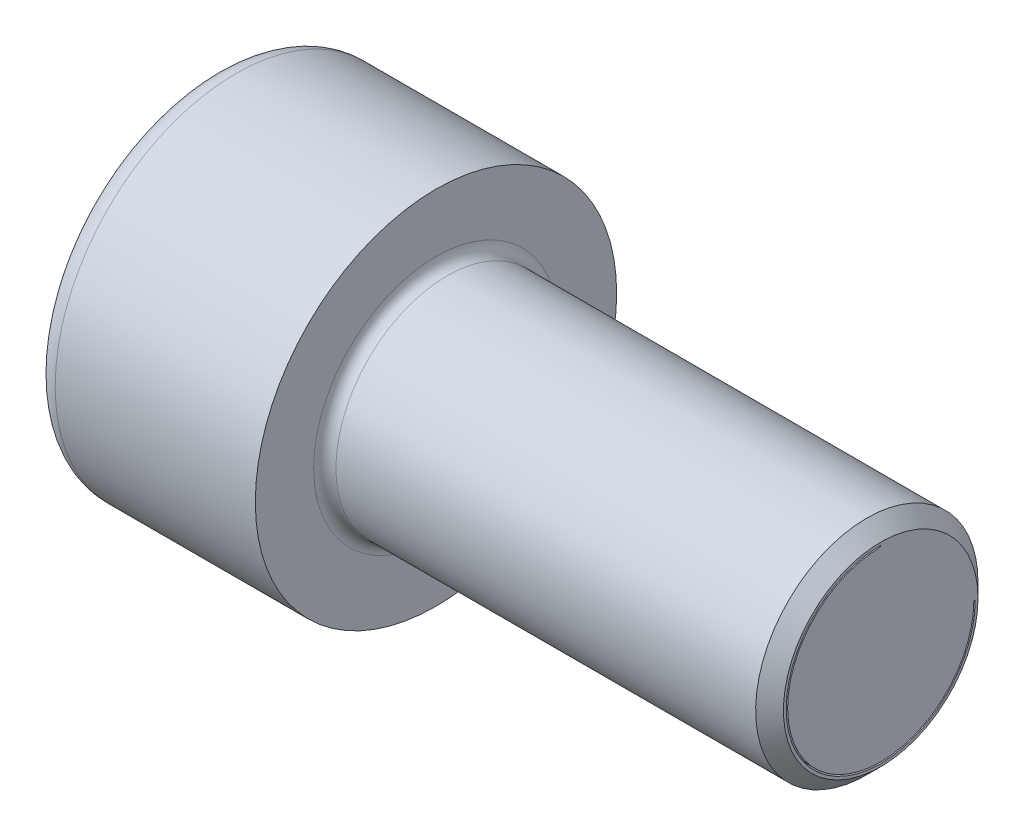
ISO-10303-21;
HEADER;
FILE_DESCRIPTION(('STEP AP214'),'2;1');
FILE_NAME('part.step','',(''),(''),'','','');
FILE_SCHEMA(('AUTOMOTIVE_DESIGN { 1 0 10303 214 1 1 1 1 }'));
ENDSEC;
DATA;
#1=APPLICATION_CONTEXT('core data for automotive mechanical design processes');
#2=APPLICATION_PROTOCOL_DEFINITION('international standard','automotive_design',2000,#1);
#3=PRODUCT_CONTEXT('',#1,'mechanical');
#4=PRODUCT('Part','Part','',(#3));
#5=PRODUCT_RELATED_PRODUCT_CATEGORY('part','',(#4));
#6=PRODUCT_DEFINITION_FORMATION('','',#4);
#7=PRODUCT_DEFINITION_CONTEXT('part definition',#1,'design');
#8=PRODUCT_DEFINITION('design','',#6,#7);
#9=PRODUCT_DEFINITION_SHAPE('','',#8);
#10=(LENGTH_UNIT() NAMED_UNIT(*) SI_UNIT(.MILLI.,.METRE.));
#11=(NAMED_UNIT(*) PLANE_ANGLE_UNIT() SI_UNIT($,.RADIAN.));
#12=(NAMED_UNIT(*) SI_UNIT($,.STERADIAN.) SOLID_ANGLE_UNIT());
#13=UNCERTAINTY_MEASURE_WITH_UNIT(LENGTH_MEASURE(1.E-05),#10,'distance_accuracy_value','');
#14=(GEOMETRIC_REPRESENTATION_CONTEXT(3) GLOBAL_UNCERTAINTY_ASSIGNED_CONTEXT((#13)) GLOBAL_UNIT_ASSIGNED_CONTEXT((#10,
#11,#12)) REPRESENTATION_CONTEXT('',''));
#15=CARTESIAN_POINT('',(0.,0.,0.));
#16=DIRECTION('',(0.,0.,1.));
#17=DIRECTION('',(1.,0.,0.));
#18=AXIS2_PLACEMENT_3D('',#15,#16,#17);
#19=CARTESIAN_POINT('',(-106.3,-32.,70.));
#20=DIRECTION('',(1.,0.,0.));
#21=DIRECTION('',(0.,0.,-1.));
#22=AXIS2_PLACEMENT_3D('',#19,#20,#21);
#23=PLANE('',#22);
#24=CARTESIAN_POINT('',(-106.3,-34.,70.));
#25=DIRECTION('',(-1.,0.,0.));
#26=DIRECTION('',(0.,1.,0.));
#27=AXIS2_PLACEMENT_3D('',#24,#25,#26);
#28=CIRCLE('',#27,3.35);
#29=CARTESIAN_POINT('',(-106.3,-34.,66.65));
#30=VERTEX_POINT('',#29);
#31=CARTESIAN_POINT('',(-106.3,-30.65,70.));
#32=VERTEX_POINT('',#31);
#33=EDGE_CURVE('E58',#30,#32,#28,.T.);
#34=ORIENTED_EDGE('',*,*,#33,.T.);
#35=DIRECTION('',(0.,1.,0.));
#36=VECTOR('',#35,1.);
#37=CARTESIAN_POINT('',(-106.3,-31.3125,70.));
#38=LINE('',#37,#36);
#39=CARTESIAN_POINT('',(-106.3,-30.6,70.));
#40=VERTEX_POINT('',#39);
#41=EDGE_CURVE('E183',#32,#40,#38,.T.);
#42=ORIENTED_EDGE('',*,*,#41,.T.);
#43=CARTESIAN_POINT('',(-106.3,-34.,70.));
#44=DIRECTION('',(1.,0.,0.));
#45=DIRECTION('',(0.,1.,0.));
#46=AXIS2_PLACEMENT_3D('',#43,#44,#45);
#47=CIRCLE('',#46,3.4);
#48=CARTESIAN_POINT('',(-106.3,-34.,66.6));
#49=VERTEX_POINT('',#48);
#50=EDGE_CURVE('E286',#40,#49,#47,.T.);
#51=ORIENTED_EDGE('',*,*,#50,.T.);
#52=DIRECTION('',(0.,0.,1.));
#53=VECTOR('',#52,1.);
#54=CARTESIAN_POINT('',(-106.3,-34.,68.3125));
#55=LINE('',#54,#53);
#56=EDGE_CURVE('E316',#49,#30,#55,.T.);
#57=ORIENTED_EDGE('',*,*,#56,.T.);
#58=EDGE_LOOP('',(#34,#42,#51,#57));
#59=FACE_BOUND('',#58,.T.);
#60=ADVANCED_FACE('F40',(#59),#23,.T.);
#61=CARTESIAN_POINT('',(-107.95,-34.,70.));
#62=DIRECTION('',(-1.,0.,0.));
#63=DIRECTION('',(0.,0.,1.));
#64=AXIS2_PLACEMENT_3D('',#61,#62,#63);
#65=CYLINDRICAL_SURFACE('',#64,4.);
#66=CARTESIAN_POINT('',(-94.5,-34.,70.));
#67=DIRECTION('',(1.,0.,0.));
#68=DIRECTION('',(0.,0.,-1.));
#69=AXIS2_PLACEMENT_3D('',#66,#67,#68);
#70=CIRCLE('',#69,4.);
#71=CARTESIAN_POINT('',(-94.5,-34.,66.));
#72=VERTEX_POINT('',#71);
#73=EDGE_CURVE('E11',#72,#72,#70,.F.);
#74=ORIENTED_EDGE('',*,*,#73,.T.);
#75=EDGE_LOOP('',(#74));
#76=FACE_BOUND('',#75,.T.);
#77=CARTESIAN_POINT('',(-109.6,-34.,70.));
#78=DIRECTION('',(1.,0.,0.));
#79=DIRECTION('',(0.,1.,0.));
#80=AXIS2_PLACEMENT_3D('',#77,#78,#79);
#81=CIRCLE('',#80,4.);
#82=CARTESIAN_POINT('',(-109.6,-30.,70.));
#83=VERTEX_POINT('',#82);
#84=EDGE_CURVE('E280',#83,#83,#81,.T.);
#85=ORIENTED_EDGE('',*,*,#84,.T.);
#86=EDGE_LOOP('',(#85));
#87=FACE_BOUND('',#86,.T.);
#88=ADVANCED_FACE('F204',(#76,#87),#65,.T.);
#89=CARTESIAN_POINT('',(-109.6,-34.,70.));
#90=DIRECTION('',(1.,0.,0.));
#91=DIRECTION('',(0.,0.,-1.));
#92=AXIS2_PLACEMENT_3D('',#89,#90,#91);
#93=TOROIDAL_SURFACE('',#92,4.40000000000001,0.4);
#94=CARTESIAN_POINT('',(-110.,-34.,70.));
#95=DIRECTION('',(1.,0.,0.));
#96=DIRECTION('',(0.,1.,0.));
#97=AXIS2_PLACEMENT_3D('',#94,#95,#96);
#98=CIRCLE('',#97,4.4);
#99=CARTESIAN_POINT('',(-110.,-29.6,70.));
#100=VERTEX_POINT('',#99);
#101=EDGE_CURVE('E171',#100,#100,#98,.T.);
#102=ORIENTED_EDGE('',*,*,#101,.T.);
#103=EDGE_LOOP('',(#102));
#104=FACE_BOUND('',#103,.T.);
#105=ORIENTED_EDGE('',*,*,#84,.F.);
#106=EDGE_LOOP('',(#105));
#107=FACE_BOUND('',#106,.T.);
#108=ADVANCED_FACE('F199',(#104,#107),#93,.F.);
#109=CARTESIAN_POINT('',(-110.,-28.55,70.));
#110=DIRECTION('',(1.,0.,0.));
#111=DIRECTION('',(0.,0.,-1.));
#112=AXIS2_PLACEMENT_3D('',#109,#110,#111);
#113=PLANE('',#112);
#114=CARTESIAN_POINT('',(-110.,-34.,70.));
#115=DIRECTION('',(1.,0.,0.));
#116=DIRECTION('',(0.,1.,0.));
#117=AXIS2_PLACEMENT_3D('',#114,#115,#116);
#118=CIRCLE('',#117,6.5);
#119=CARTESIAN_POINT('',(-110.,-27.5,70.));
#120=VERTEX_POINT('',#119);
#121=EDGE_CURVE('E168',#120,#120,#118,.T.);
#122=ORIENTED_EDGE('',*,*,#121,.T.);
#123=EDGE_LOOP('',(#122));
#124=FACE_BOUND('',#123,.T.);
#125=ORIENTED_EDGE('',*,*,#101,.F.);
#126=EDGE_LOOP('',(#125));
#127=FACE_BOUND('',#126,.T.);
#128=ADVANCED_FACE('F203',(#124,#127),#113,.T.);
#129=CARTESIAN_POINT('',(-113.6,-34.,70.));
#130=DIRECTION('',(-1.,0.,0.));
#131=DIRECTION('',(0.,0.,1.));
#132=AXIS2_PLACEMENT_3D('',#129,#130,#131);
#133=CYLINDRICAL_SURFACE('',#132,6.5);
#134=CARTESIAN_POINT('',(-117.2,-34.,70.));
#135=DIRECTION('',(1.,0.,0.));
#136=DIRECTION('',(0.,1.,0.));
#137=AXIS2_PLACEMENT_3D('',#134,#135,#136);
#138=CIRCLE('',#137,6.5);
#139=CARTESIAN_POINT('',(-117.2,-27.5,70.));
#140=VERTEX_POINT('',#139);
#141=EDGE_CURVE('E283',#140,#140,#138,.T.);
#142=ORIENTED_EDGE('',*,*,#141,.T.);
#143=EDGE_LOOP('',(#142));
#144=FACE_BOUND('',#143,.T.);
#145=ORIENTED_EDGE('',*,*,#121,.F.);
#146=EDGE_LOOP('',(#145));
#147=FACE_BOUND('',#146,.T.);
#148=ADVANCED_FACE('F209',(#144,#147),#133,.T.);
#149=CARTESIAN_POINT('',(-117.2,-34.,70.));
#150=DIRECTION('',(1.,0.,0.));
#151=DIRECTION('',(0.,0.,-1.));
#152=AXIS2_PLACEMENT_3D('',#149,#150,#151);
#153=TOROIDAL_SURFACE('',#152,5.7,0.8);
#154=CARTESIAN_POINT('',(-118.,-34.,70.));
#155=DIRECTION('',(1.,0.,0.));
#156=DIRECTION('',(0.,1.,0.));
#157=AXIS2_PLACEMENT_3D('',#154,#155,#156);
#158=CIRCLE('',#157,5.7);
#159=CARTESIAN_POINT('',(-118.,-28.3,70.));
#160=VERTEX_POINT('',#159);
#161=EDGE_CURVE('E298',#160,#160,#158,.T.);
#162=ORIENTED_EDGE('',*,*,#161,.T.);
#163=EDGE_LOOP('',(#162));
#164=FACE_BOUND('',#163,.T.);
#165=ORIENTED_EDGE('',*,*,#141,.F.);
#166=EDGE_LOOP('',(#165));
#167=FACE_BOUND('',#166,.T.);
#168=ADVANCED_FACE('F213',(#164,#167),#153,.T.);
#169=CARTESIAN_POINT('',(-118.,-31.15,70.));
#170=DIRECTION('',(-1.,0.,0.));
#171=DIRECTION('',(0.,0.,1.));
#172=AXIS2_PLACEMENT_3D('',#169,#170,#171);
#173=PLANE('',#172);
#174=ORIENTED_EDGE('',*,*,#161,.F.);
#175=EDGE_LOOP('',(#174));
#176=FACE_BOUND('',#175,.T.);
#177=DIRECTION('',(0.,-0.5,-0.86602540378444));
#178=VECTOR('',#177,1.);
#179=CARTESIAN_POINT('',(-118.,-35.8088135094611,72.8670431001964));
#180=LINE('',#179,#178);
#181=CARTESIAN_POINT('',(-118.,-35.7320508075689,73.));
#182=VERTEX_POINT('',#181);
#183=CARTESIAN_POINT('',(-118.,-37.4641016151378,70.));
#184=VERTEX_POINT('',#183);
#185=EDGE_CURVE('E172',#182,#184,#180,.T.);
#186=ORIENTED_EDGE('',*,*,#185,.T.);
#187=DIRECTION('',(0.,0.5,-0.866025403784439));
#188=VECTOR('',#187,1.);
#189=CARTESIAN_POINT('',(-118.,-36.6748389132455,68.6329568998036));
#190=LINE('',#189,#188);
#191=CARTESIAN_POINT('',(-118.,-35.7320508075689,67.));
#192=VERTEX_POINT('',#191);
#193=EDGE_CURVE('E293',#184,#192,#190,.T.);
#194=ORIENTED_EDGE('',*,*,#193,.T.);
#195=DIRECTION('',(0.,1.,0.));
#196=VECTOR('',#195,1.);
#197=CARTESIAN_POINT('',(-118.,-33.4410254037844,67.));
#198=LINE('',#197,#196);
#199=CARTESIAN_POINT('',(-118.,-32.2679491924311,67.));
#200=VERTEX_POINT('',#199);
#201=EDGE_CURVE('E132',#192,#200,#198,.T.);
#202=ORIENTED_EDGE('',*,*,#201,.T.);
#203=DIRECTION('',(0.,0.5,0.86602540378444));
#204=VECTOR('',#203,1.);
#205=CARTESIAN_POINT('',(-118.,-31.4786864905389,68.3670431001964));
#206=LINE('',#205,#204);
#207=CARTESIAN_POINT('',(-118.,-30.5358983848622,70.));
#208=VERTEX_POINT('',#207);
#209=EDGE_CURVE('E294',#200,#208,#206,.T.);
#210=ORIENTED_EDGE('',*,*,#209,.T.);
#211=DIRECTION('',(0.,-0.5,0.866025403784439));
#212=VECTOR('',#211,1.);
#213=CARTESIAN_POINT('',(-118.,-30.6126610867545,70.1329568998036));
#214=LINE('',#213,#212);
#215=CARTESIAN_POINT('',(-118.,-32.2679491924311,73.0000000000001));
#216=VERTEX_POINT('',#215);
#217=EDGE_CURVE('E176',#208,#216,#214,.T.);
#218=ORIENTED_EDGE('',*,*,#217,.T.);
#219=DIRECTION('',(0.,-1.,0.));
#220=VECTOR('',#219,1.);
#221=CARTESIAN_POINT('',(-118.,-31.7089745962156,73.));
#222=LINE('',#221,#220);
#223=EDGE_CURVE('E173',#216,#182,#222,.T.);
#224=ORIENTED_EDGE('',*,*,#223,.T.);
#225=EDGE_LOOP('',(#186,#194,#202,#210,#218,#224));
#226=FACE_BOUND('',#225,.T.);
#227=ADVANCED_FACE('F217',(#176,#226),#173,.T.);
#228=CARTESIAN_POINT('',(-114.,-34.,70.));
#229=DIRECTION('',(-1.,0.,0.));
#230=DIRECTION('',(0.,0.,1.));
#231=AXIS2_PLACEMENT_3D('',#228,#229,#230);
#232=PLANE('',#231);
#233=DIRECTION('',(0.,1.,0.));
#234=VECTOR('',#233,1.);
#235=CARTESIAN_POINT('',(-114.,-35.7320508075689,73.));
#236=LINE('',#235,#234);
#237=CARTESIAN_POINT('',(-114.,-35.7320508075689,73.));
#238=VERTEX_POINT('',#237);
#239=CARTESIAN_POINT('',(-114.,-32.2679491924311,73.0000000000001));
#240=VERTEX_POINT('',#239);
#241=EDGE_CURVE('E177',#238,#240,#236,.T.);
#242=ORIENTED_EDGE('',*,*,#241,.T.);
#243=DIRECTION('',(0.,0.5,-0.866025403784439));
#244=VECTOR('',#243,1.);
#245=CARTESIAN_POINT('',(-114.,-32.2679491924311,73.0000000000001));
#246=LINE('',#245,#244);
#247=CARTESIAN_POINT('',(-114.,-30.5358983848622,70.));
#248=VERTEX_POINT('',#247);
#249=EDGE_CURVE('E158',#240,#248,#246,.T.);
#250=ORIENTED_EDGE('',*,*,#249,.T.);
#251=DIRECTION('',(0.,-0.5,-0.86602540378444));
#252=VECTOR('',#251,1.);
#253=CARTESIAN_POINT('',(-114.,-30.5358983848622,70.));
#254=LINE('',#253,#252);
#255=CARTESIAN_POINT('',(-114.,-32.2679491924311,67.));
#256=VERTEX_POINT('',#255);
#257=EDGE_CURVE('E152',#248,#256,#254,.T.);
#258=ORIENTED_EDGE('',*,*,#257,.T.);
#259=DIRECTION('',(0.,-1.,0.));
#260=VECTOR('',#259,1.);
#261=CARTESIAN_POINT('',(-114.,-32.2679491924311,67.));
#262=LINE('',#261,#260);
#263=CARTESIAN_POINT('',(-114.,-35.7320508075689,67.));
#264=VERTEX_POINT('',#263);
#265=EDGE_CURVE('E130',#256,#264,#262,.T.);
#266=ORIENTED_EDGE('',*,*,#265,.T.);
#267=DIRECTION('',(0.,-0.5,0.866025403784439));
#268=VECTOR('',#267,1.);
#269=CARTESIAN_POINT('',(-114.,-35.7320508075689,67.));
#270=LINE('',#269,#268);
#271=CARTESIAN_POINT('',(-114.,-37.4641016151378,70.));
#272=VERTEX_POINT('',#271);
#273=EDGE_CURVE('E141',#264,#272,#270,.T.);
#274=ORIENTED_EDGE('',*,*,#273,.T.);
#275=DIRECTION('',(0.,0.5,0.86602540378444));
#276=VECTOR('',#275,1.);
#277=CARTESIAN_POINT('',(-114.,-37.4641016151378,70.));
#278=LINE('',#277,#276);
#279=EDGE_CURVE('E146',#272,#238,#278,.T.);
#280=ORIENTED_EDGE('',*,*,#279,.T.);
#281=EDGE_LOOP('',(#242,#250,#258,#266,#274,#280));
#282=FACE_BOUND('',#281,.T.);
#283=ADVANCED_FACE('F150',(#282),#232,.T.);
#284=CARTESIAN_POINT('',(-114.,-35.7320508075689,67.));
#285=DIRECTION('',(0.,0.,1.));
#286=DIRECTION('',(1.,0.,0.));
#287=AXIS2_PLACEMENT_3D('',#284,#285,#286);
#288=PLANE('',#287);
#289=ORIENTED_EDGE('',*,*,#201,.F.);
#290=DIRECTION('',(-1.,0.,0.));
#291=VECTOR('',#290,1.);
#292=CARTESIAN_POINT('',(-114.,-35.7320508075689,67.));
#293=LINE('',#292,#291);
#294=EDGE_CURVE('E126',#264,#192,#293,.T.);
#295=ORIENTED_EDGE('',*,*,#294,.F.);
#296=ORIENTED_EDGE('',*,*,#265,.F.);
#297=DIRECTION('',(-1.,0.,0.));
#298=VECTOR('',#297,1.);
#299=CARTESIAN_POINT('',(-114.,-32.2679491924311,67.));
#300=LINE('',#299,#298);
#301=EDGE_CURVE('E136',#256,#200,#300,.T.);
#302=ORIENTED_EDGE('',*,*,#301,.T.);
#303=EDGE_LOOP('',(#289,#295,#296,#302));
#304=FACE_BOUND('',#303,.T.);
#305=ADVANCED_FACE('F128',(#304),#288,.T.);
#306=CARTESIAN_POINT('',(-114.,-37.4641016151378,70.));
#307=DIRECTION('',(0.,0.866025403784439,0.5));
#308=DIRECTION('',(0.,-0.5,0.866025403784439));
#309=AXIS2_PLACEMENT_3D('',#306,#307,#308);
#310=PLANE('',#309);
#311=ORIENTED_EDGE('',*,*,#193,.F.);
#312=DIRECTION('',(-1.,0.,0.));
#313=VECTOR('',#312,1.);
#314=CARTESIAN_POINT('',(-114.,-37.4641016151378,70.));
#315=LINE('',#314,#313);
#316=EDGE_CURVE('E137',#272,#184,#315,.T.);
#317=ORIENTED_EDGE('',*,*,#316,.F.);
#318=ORIENTED_EDGE('',*,*,#273,.F.);
#319=ORIENTED_EDGE('',*,*,#294,.T.);
#320=EDGE_LOOP('',(#311,#317,#318,#319));
#321=FACE_BOUND('',#320,.T.);
#322=ADVANCED_FACE('F142',(#321),#310,.T.);
#323=CARTESIAN_POINT('',(-114.,-35.7320508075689,73.));
#324=DIRECTION('',(0.,0.86602540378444,-0.5));
#325=DIRECTION('',(0.,0.5,0.86602540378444));
#326=AXIS2_PLACEMENT_3D('',#323,#324,#325);
#327=PLANE('',#326);
#328=ORIENTED_EDGE('',*,*,#185,.F.);
#329=DIRECTION('',(-1.,0.,0.));
#330=VECTOR('',#329,1.);
#331=CARTESIAN_POINT('',(-114.,-35.7320508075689,73.));
#332=LINE('',#331,#330);
#333=EDGE_CURVE('E180',#238,#182,#332,.T.);
#334=ORIENTED_EDGE('',*,*,#333,.F.);
#335=ORIENTED_EDGE('',*,*,#279,.F.);
#336=ORIENTED_EDGE('',*,*,#316,.T.);
#337=EDGE_LOOP('',(#328,#334,#335,#336));
#338=FACE_BOUND('',#337,.T.);
#339=ADVANCED_FACE('F228',(#338),#327,.T.);
#340=CARTESIAN_POINT('',(-114.,-32.2679491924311,73.0000000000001));
#341=DIRECTION('',(0.,0.,-1.));
#342=DIRECTION('',(-1.,0.,0.));
#343=AXIS2_PLACEMENT_3D('',#340,#341,#342);
#344=PLANE('',#343);
#345=ORIENTED_EDGE('',*,*,#223,.F.);
#346=DIRECTION('',(-1.,0.,0.));
#347=VECTOR('',#346,1.);
#348=CARTESIAN_POINT('',(-114.,-32.2679491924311,73.0000000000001));
#349=LINE('',#348,#347);
#350=EDGE_CURVE('E167',#240,#216,#349,.T.);
#351=ORIENTED_EDGE('',*,*,#350,.F.);
#352=ORIENTED_EDGE('',*,*,#241,.F.);
#353=ORIENTED_EDGE('',*,*,#333,.T.);
#354=EDGE_LOOP('',(#345,#351,#352,#353));
#355=FACE_BOUND('',#354,.T.);
#356=ADVANCED_FACE('F231',(#355),#344,.T.);
#357=CARTESIAN_POINT('',(-114.,-30.5358983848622,70.));
#358=DIRECTION('',(0.,-0.866025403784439,-0.5));
#359=DIRECTION('',(0.,0.5,-0.866025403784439));
#360=AXIS2_PLACEMENT_3D('',#357,#358,#359);
#361=PLANE('',#360);
#362=ORIENTED_EDGE('',*,*,#217,.F.);
#363=DIRECTION('',(-1.,0.,0.));
#364=VECTOR('',#363,1.);
#365=CARTESIAN_POINT('',(-114.,-30.5358983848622,70.));
#366=LINE('',#365,#364);
#367=EDGE_CURVE('E163',#248,#208,#366,.T.);
#368=ORIENTED_EDGE('',*,*,#367,.F.);
#369=ORIENTED_EDGE('',*,*,#249,.F.);
#370=ORIENTED_EDGE('',*,*,#350,.T.);
#371=EDGE_LOOP('',(#362,#368,#369,#370));
#372=FACE_BOUND('',#371,.T.);
#373=ADVANCED_FACE('F235',(#372),#361,.T.);
#374=CARTESIAN_POINT('',(-114.,-32.2679491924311,67.));
#375=DIRECTION('',(0.,-0.86602540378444,0.5));
#376=DIRECTION('',(0.,-0.5,-0.86602540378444));
#377=AXIS2_PLACEMENT_3D('',#374,#375,#376);
#378=PLANE('',#377);
#379=ORIENTED_EDGE('',*,*,#209,.F.);
#380=ORIENTED_EDGE('',*,*,#301,.F.);
#381=ORIENTED_EDGE('',*,*,#257,.F.);
#382=ORIENTED_EDGE('',*,*,#367,.T.);
#383=EDGE_LOOP('',(#379,#380,#381,#382));
#384=FACE_BOUND('',#383,.T.);
#385=ADVANCED_FACE('F239',(#384),#378,.T.);
#386=CARTESIAN_POINT('',(-94.0000000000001,-34.,70.));
#387=DIRECTION('',(1.,0.,0.));
#388=DIRECTION('',(0.,0.,-1.));
#389=AXIS2_PLACEMENT_3D('',#386,#387,#388);
#390=PLANE('',#389);
#391=CARTESIAN_POINT('',(-94.0000000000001,-34.,70.));
#392=DIRECTION('',(1.,0.,0.));
#393=DIRECTION('',(0.,0.,-1.));
#394=AXIS2_PLACEMENT_3D('',#391,#392,#393);
#395=CIRCLE('',#394,3.5);
#396=CARTESIAN_POINT('',(-94.0000000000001,-34.,66.5));
#397=VERTEX_POINT('',#396);
#398=EDGE_CURVE('E50',#397,#397,#395,.T.);
#399=ORIENTED_EDGE('',*,*,#398,.T.);
#400=EDGE_LOOP('',(#399));
#401=FACE_BOUND('',#400,.T.);
#402=CARTESIAN_POINT('',(-94.0000000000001,-34.,70.));
#403=DIRECTION('',(1.,0.,0.));
#404=DIRECTION('',(0.,1.,0.));
#405=AXIS2_PLACEMENT_3D('',#402,#403,#404);
#406=CIRCLE('',#405,3.35);
#407=CARTESIAN_POINT('',(-94.0000000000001,-30.65,70.));
#408=VERTEX_POINT('',#407);
#409=CARTESIAN_POINT('',(-94.0000000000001,-34.,66.65));
#410=VERTEX_POINT('',#409);
#411=EDGE_CURVE('E77',#408,#410,#406,.T.);
#412=ORIENTED_EDGE('',*,*,#411,.T.);
#413=DIRECTION('',(0.,0.,-1.));
#414=VECTOR('',#413,1.);
#415=CARTESIAN_POINT('',(-94.0000000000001,-34.,68.3125));
#416=LINE('',#415,#414);
#417=CARTESIAN_POINT('',(-94.0000000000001,-34.,66.6));
#418=VERTEX_POINT('',#417);
#419=EDGE_CURVE('E186',#410,#418,#416,.T.);
#420=ORIENTED_EDGE('',*,*,#419,.T.);
#421=CARTESIAN_POINT('',(-94.0000000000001,-34.,70.));
#422=DIRECTION('',(-1.,0.,0.));
#423=DIRECTION('',(0.,1.,0.));
#424=AXIS2_PLACEMENT_3D('',#421,#422,#423);
#425=CIRCLE('',#424,3.4);
#426=CARTESIAN_POINT('',(-94.0000000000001,-30.6,70.));
#427=VERTEX_POINT('',#426);
#428=EDGE_CURVE('E289',#418,#427,#425,.T.);
#429=ORIENTED_EDGE('',*,*,#428,.T.);
#430=DIRECTION('',(0.,-1.,0.));
#431=VECTOR('',#430,1.);
#432=CARTESIAN_POINT('',(-94.0000000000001,-32.3125,70.));
#433=LINE('',#432,#431);
#434=EDGE_CURVE('E288',#427,#408,#433,.T.);
#435=ORIENTED_EDGE('',*,*,#434,.T.);
#436=EDGE_LOOP('',(#412,#420,#429,#435));
#437=FACE_BOUND('',#436,.T.);
#438=ADVANCED_FACE('F243',(#401,#437),#390,.T.);
#439=CARTESIAN_POINT('',(-100.15,-34.,66.625));
#440=DIRECTION('',(0.,-1.,0.));
#441=DIRECTION('',(0.,0.,-1.));
#442=AXIS2_PLACEMENT_3D('',#439,#440,#441);
#443=PLANE('',#442);
#444=DIRECTION('',(1.,0.,0.));
#445=VECTOR('',#444,1.);
#446=CARTESIAN_POINT('',(-94.0000000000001,-34.,66.6));
#447=LINE('',#446,#445);
#448=EDGE_CURVE('E89',#49,#418,#447,.T.);
#449=ORIENTED_EDGE('',*,*,#448,.T.);
#450=ORIENTED_EDGE('',*,*,#419,.F.);
#451=DIRECTION('',(-1.,0.,0.));
#452=VECTOR('',#451,1.);
#453=CARTESIAN_POINT('',(-106.3,-34.,66.65));
#454=LINE('',#453,#452);
#455=EDGE_CURVE('E193',#410,#30,#454,.T.);
#456=ORIENTED_EDGE('',*,*,#455,.T.);
#457=ORIENTED_EDGE('',*,*,#56,.F.);
#458=EDGE_LOOP('',(#449,#450,#456,#457));
#459=FACE_BOUND('',#458,.T.);
#460=ADVANCED_FACE('F247',(#459),#443,.T.);
#461=CARTESIAN_POINT('',(-100.15,-30.625,70.));
#462=DIRECTION('',(0.,0.,1.));
#463=DIRECTION('',(1.,0.,0.));
#464=AXIS2_PLACEMENT_3D('',#461,#462,#463);
#465=PLANE('',#464);
#466=ORIENTED_EDGE('',*,*,#41,.F.);
#467=DIRECTION('',(1.,0.,0.));
#468=VECTOR('',#467,1.);
#469=CARTESIAN_POINT('',(-106.3,-30.65,70.));
#470=LINE('',#469,#468);
#471=EDGE_CURVE('E189',#32,#408,#470,.T.);
#472=ORIENTED_EDGE('',*,*,#471,.T.);
#473=ORIENTED_EDGE('',*,*,#434,.F.);
#474=DIRECTION('',(-1.,0.,0.));
#475=VECTOR('',#474,1.);
#476=CARTESIAN_POINT('',(-94.0000000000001,-30.6,70.));
#477=LINE('',#476,#475);
#478=EDGE_CURVE('E194',#427,#40,#477,.T.);
#479=ORIENTED_EDGE('',*,*,#478,.T.);
#480=EDGE_LOOP('',(#466,#472,#473,#479));
#481=FACE_BOUND('',#480,.T.);
#482=ADVANCED_FACE('F251',(#481),#465,.T.);
#483=CARTESIAN_POINT('',(-100.15,-34.,70.));
#484=DIRECTION('',(-1.,0.,0.));
#485=DIRECTION('',(0.,0.,1.));
#486=AXIS2_PLACEMENT_3D('',#483,#484,#485);
#487=CYLINDRICAL_SURFACE('',#486,3.35);
#488=ORIENTED_EDGE('',*,*,#471,.F.);
#489=ORIENTED_EDGE('',*,*,#33,.F.);
#490=ORIENTED_EDGE('',*,*,#455,.F.);
#491=ORIENTED_EDGE('',*,*,#411,.F.);
#492=EDGE_LOOP('',(#488,#489,#490,#491));
#493=FACE_BOUND('',#492,.T.);
#494=ADVANCED_FACE('F253',(#493),#487,.T.);
#495=CARTESIAN_POINT('',(-100.15,-34.,70.));
#496=DIRECTION('',(-1.,0.,0.));
#497=DIRECTION('',(0.,0.,1.));
#498=AXIS2_PLACEMENT_3D('',#495,#496,#497);
#499=CYLINDRICAL_SURFACE('',#498,3.4);
#500=ORIENTED_EDGE('',*,*,#448,.F.);
#501=ORIENTED_EDGE('',*,*,#50,.F.);
#502=ORIENTED_EDGE('',*,*,#478,.F.);
#503=ORIENTED_EDGE('',*,*,#428,.F.);
#504=EDGE_LOOP('',(#500,#501,#502,#503));
#505=FACE_BOUND('',#504,.T.);
#506=ADVANCED_FACE('F42',(#505),#499,.F.);
#507=CARTESIAN_POINT('',(-94.0000000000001,-34.,70.));
#508=DIRECTION('',(-1.,0.,0.));
#509=DIRECTION('',(0.,0.,1.));
#510=AXIS2_PLACEMENT_3D('',#507,#508,#509);
#511=CONICAL_SURFACE('',#510,3.5,0.785398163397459);
#512=ORIENTED_EDGE('',*,*,#73,.F.);
#513=EDGE_LOOP('',(#512));
#514=FACE_BOUND('',#513,.T.);
#515=ORIENTED_EDGE('',*,*,#398,.F.);
#516=EDGE_LOOP('',(#515));
#517=FACE_BOUND('',#516,.T.);
#518=ADVANCED_FACE('F260',(#514,#517),#511,.T.);
#519=CLOSED_SHELL('',(#60,#88,#108,#128,#148,#168,#227,#283,#305,#322,#339,#356,#373,#385,#438,
#460,#482,#494,#506,#518));
#520=MANIFOLD_SOLID_BREP('B2',#519);
#521=ADVANCED_BREP_SHAPE_REPRESENTATION('',(#18,#520),#14);
#522=SHAPE_DEFINITION_REPRESENTATION(#9,#521);
ENDSEC;
END-ISO-10303-21;
